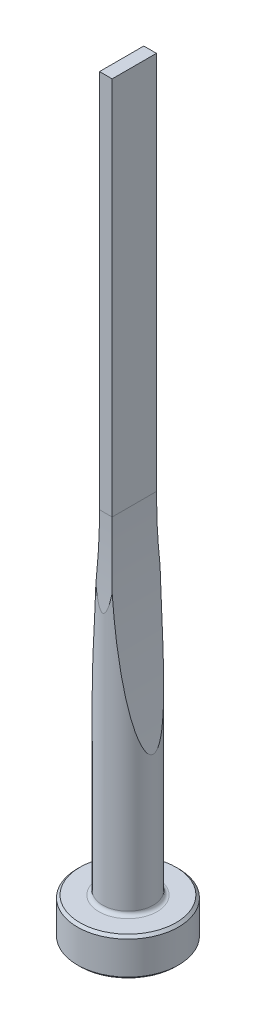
from build123d import *

# Parameters (mm, degrees)
CUT_EXTRUDE1_DEPTH = 5
CUT_EXTRUDE2_DEPTH = 5


with BuildPart() as part:
    # Sketch1 → Revolve1 (revolve)
    with BuildSketch(Plane.XY, mode=Mode.PRIVATE) as revolve1_sk:
        with BuildLine():
            Line((0, 0), (3.8, 0))
            Line((3.8, 0), (4, 0.2))
            Line((4, 0.2), (4, 2.8))
            Line((4, 2.8), (3.8, 3))
            Line((3.8, 3), (2.3, 3))
            ThreePointArc((2.3, 3), (2.087867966, 3.087867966), (2, 3.3))
            Line((2, 3.3), (2, 60))
            Line((2, 60), (0, 60))
            Line((0, 60), (0, 0))
        make_face()
    revolve(revolve1_sk.sketch.rotate(Axis((0, 60, 0), (0, -1, 0)), 180), axis=Axis((0, 60, 0), (0, -1, 0)))

    # Sketch2 → Cut-Extrude1 (cut, symmetric)
    with BuildSketch(Plane.XY):
        with BuildLine():
            Line((0.5, 60), (0.5, 30))
            ThreePointArc((0.5, 30), (0.875784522, 21.784161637), (2, 13.636931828))
            Line((2, 13.636931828), (2, 60))
            Line((2, 60), (0.5, 60))
        make_face()
        with BuildLine():
            Line((-0.5, 60), (-0.5, 30))
            ThreePointArc((-0.5, 30), (-0.875784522, 21.784161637), (-2, 13.636931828))
            Line((-2, 13.636931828), (-2, 60))
            Line((-2, 60), (-0.5, 60))
        make_face()
    extrude(amount=CUT_EXTRUDE1_DEPTH, both=True, mode=Mode.SUBTRACT)

    # Sketch3 → Cut-Extrude2 (cut, symmetric)
    with BuildSketch(Plane(origin=(0, 0, 0), x_dir=(0, 0, -1), z_dir=(1, 0, 0))):
        with BuildLine():
            Line((1.75, 60), (1.75, 30))
            ThreePointArc((1.75, 30), (1.812521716, 26.645898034), (2, 23.296456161))
            Line((2, 23.296456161), (2, 60))
            Line((2, 60), (1.75, 60))
        make_face()
        with BuildLine():
            Line((-1.75, 60), (-1.75, 30))
            ThreePointArc((-1.75, 30), (-1.812521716, 26.645898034), (-2, 23.296456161))
            Line((-2, 23.296456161), (-2, 60))
            Line((-2, 60), (-1.75, 60))
        make_face()
    extrude(amount=CUT_EXTRUDE2_DEPTH, both=True, mode=Mode.SUBTRACT)


solid = part.part
